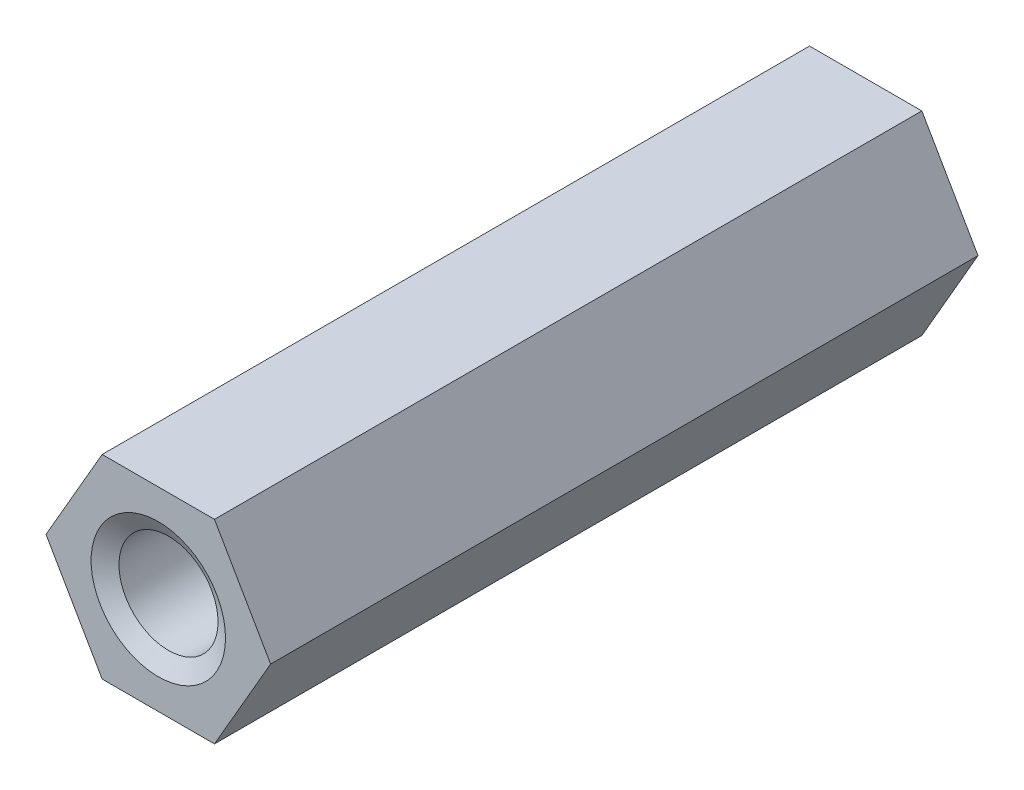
from build123d import *
from OCP.BRepFilletAPI import BRepFilletAPI_MakeChamfer

# Parameters (mm, degrees)
BOSS_EXTRUDE1_DEPTH = 10
SKETCH3_R           = 1.4
CUT_EXTRUDE1_DEPTH  = 6
CHAMFER2_SIZE       = 1.2
CHAMFER2_SIZE2      = 0.692820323
CHAMFER3_SIZE       = 0.5
CHAMFER3_SIZE2      = 0.288675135


with BuildPart() as part:
    # Sketch1 → Boss-Extrude1 (new, symmetric)
    with BuildSketch(Plane.XY):
        Polygon((1.58771324, 2.75), (-1.58771324, 2.75), (-3.175426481, 0), (-1.58771324, -2.75), (1.58771324, -2.75), (3.175426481, 0), align=None)
    extrude(amount=BOSS_EXTRUDE1_DEPTH, both=True)

    # Sketch3 → Cut-Extrude1 (cut)
    with BuildSketch(Plane.XY.offset(10)):
        Circle(SKETCH3_R)
    cut_extrude1 = extrude(amount=-CUT_EXTRUDE1_DEPTH, mode=Mode.SUBTRACT)

    # Mirror3: Cut-Extrude1 across plane
    add(cut_extrude1.mirror(Plane.XY), mode=Mode.SUBTRACT)

    # Chamfer2
    chamfer2_edges = [part.edges().sort_by_distance(p)[0] for p in [
        (-1.4, 0, 4),
    ]]
    chamfer2_side = [part.faces().sort_by_distance(p)[0] for p in [
        (0, 0, 4),
    ]]
    chamfer(chamfer2_edges, length=CHAMFER2_SIZE, length2=CHAMFER2_SIZE2, reference=chamfer2_side[0])

    # Chamfer3: one chamfer whose edges measure the first distance from different faces: ONE call of the kernel's chamfer builder (chamfer() names one face for all edges)
    chamfer3_edges_1 = [part.edges().sort_by_distance(p)[0] for p in [
        (-1.4, 0, 10),
    ]]
    chamfer3_side_1 = [part.faces().sort_by_distance(p)[0] for p in [
        (0, 2.665986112, 10),
    ]]
    chamfer3_edges_2 = [part.edges().sort_by_distance(p)[0] for p in [
        (-1.4, 0, -10),
    ]]
    chamfer3_side_2 = [part.faces().sort_by_distance(p)[0] for p in [
        (-1.4, 0, -7),
    ]]
    chamfer3 = BRepFilletAPI_MakeChamfer(part.part.solid().wrapped)
    for e in chamfer3_edges_1:
        chamfer3.Add(CHAMFER3_SIZE, CHAMFER3_SIZE2, e.wrapped, chamfer3_side_1[0].wrapped)  # the first distance lies on this face
    for e in chamfer3_edges_2:
        chamfer3.Add(CHAMFER3_SIZE, CHAMFER3_SIZE2, e.wrapped, chamfer3_side_2[0].wrapped)  # the first distance lies on this face
    add(Compound.cast(chamfer3.Shape()), mode=Mode.REPLACE)


solid = part.part
